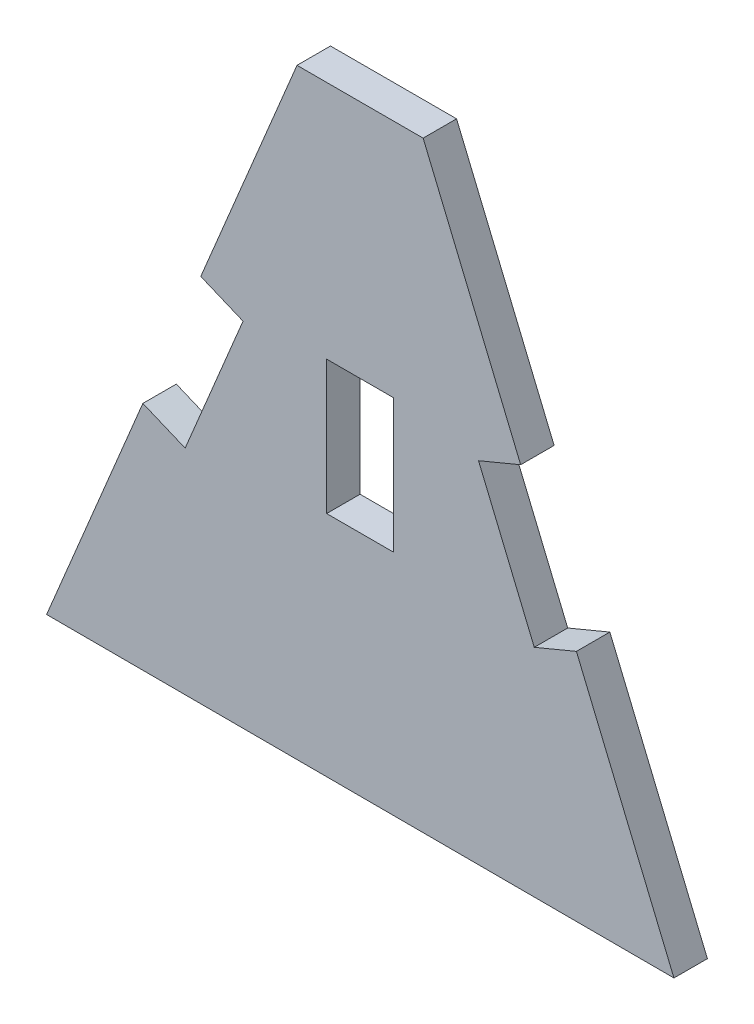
from build123d import *

# Parameters (mm, degrees)
SKETCH1_W           = 3.048
SKETCH1_H           = 6.096
BOSS_EXTRUDE1_DEPTH = 1.524


with BuildPart() as part:
    # Sketch1 → Boss-Extrude1 (new body)
    with BuildSketch(Plane.XY):
        Polygon((-14.296297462, -13.666463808), (-9.908811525, -3.139365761), (-7.982169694, -3.942351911), (-5.343865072, 2.387854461), (-7.270506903, 3.190840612), (-2.883020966, 13.717938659), (2.864586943, 13.717938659), (7.310433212, 3.047996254), (5.389818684, 2.247733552), (7.929836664, -3.848258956), (9.850451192, -3.047996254), (14.296297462, -13.717938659), align=None)
        with Locations((-0.009217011, -0.252061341)):
            Rectangle(SKETCH1_W, SKETCH1_H, mode=Mode.SUBTRACT)
    extrude(amount=BOSS_EXTRUDE1_DEPTH)


solid = part.part
